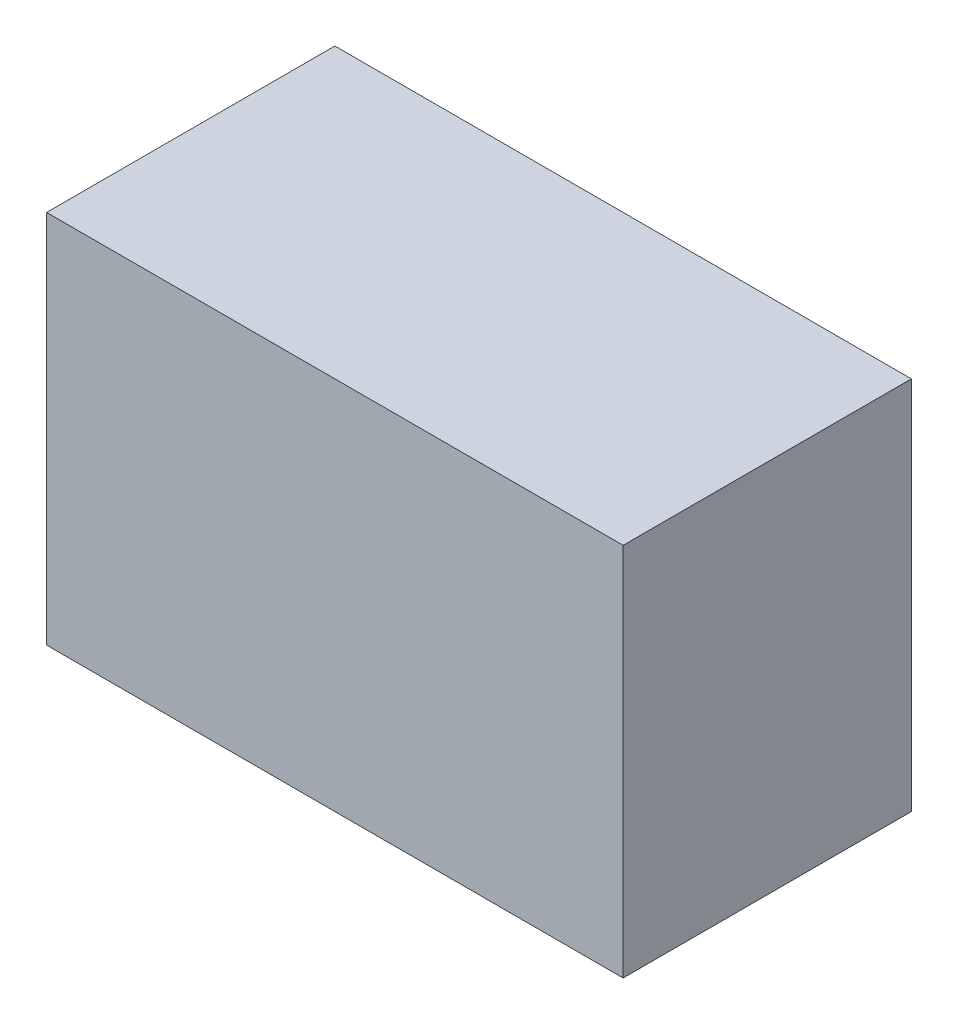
ISO-10303-21;
HEADER;
FILE_DESCRIPTION(('STEP AP214'),'2;1');
FILE_NAME('part.step','',(''),(''),'','','');
FILE_SCHEMA(('AUTOMOTIVE_DESIGN { 1 0 10303 214 1 1 1 1 }'));
ENDSEC;
DATA;
#1=APPLICATION_CONTEXT('core data for automotive mechanical design processes');
#2=APPLICATION_PROTOCOL_DEFINITION('international standard','automotive_design',2000,#1);
#3=PRODUCT_CONTEXT('',#1,'mechanical');
#4=PRODUCT('Part','Part','',(#3));
#5=PRODUCT_RELATED_PRODUCT_CATEGORY('part','',(#4));
#6=PRODUCT_DEFINITION_FORMATION('','',#4);
#7=PRODUCT_DEFINITION_CONTEXT('part definition',#1,'design');
#8=PRODUCT_DEFINITION('design','',#6,#7);
#9=PRODUCT_DEFINITION_SHAPE('','',#8);
#10=(LENGTH_UNIT() NAMED_UNIT(*) SI_UNIT(.MILLI.,.METRE.));
#11=(NAMED_UNIT(*) PLANE_ANGLE_UNIT() SI_UNIT($,.RADIAN.));
#12=(NAMED_UNIT(*) SI_UNIT($,.STERADIAN.) SOLID_ANGLE_UNIT());
#13=UNCERTAINTY_MEASURE_WITH_UNIT(LENGTH_MEASURE(1.E-05),#10,'distance_accuracy_value','');
#14=(GEOMETRIC_REPRESENTATION_CONTEXT(3) GLOBAL_UNCERTAINTY_ASSIGNED_CONTEXT((#13)) GLOBAL_UNIT_ASSIGNED_CONTEXT((#10,
#11,#12)) REPRESENTATION_CONTEXT('',''));
#15=CARTESIAN_POINT('',(0.,0.,0.));
#16=DIRECTION('',(0.,0.,1.));
#17=DIRECTION('',(1.,0.,0.));
#18=AXIS2_PLACEMENT_3D('',#15,#16,#17);
#19=CARTESIAN_POINT('',(-2.54,0.889,2.54));
#20=DIRECTION('',(1.,0.,0.));
#21=DIRECTION('',(0.,0.,-1.));
#22=AXIS2_PLACEMENT_3D('',#19,#20,#21);
#23=PLANE('',#22);
#24=DIRECTION('',(0.,-1.,0.));
#25=VECTOR('',#24,1.);
#26=CARTESIAN_POINT('',(-2.54,0.889,0.));
#27=LINE('',#26,#25);
#28=CARTESIAN_POINT('',(-2.54,0.889,0.));
#29=VERTEX_POINT('',#28);
#30=CARTESIAN_POINT('',(-2.54,-2.413,0.));
#31=VERTEX_POINT('',#30);
#32=EDGE_CURVE('E96',#29,#31,#27,.T.);
#33=ORIENTED_EDGE('',*,*,#32,.T.);
#34=DIRECTION('',(0.,0.,-1.));
#35=VECTOR('',#34,1.);
#36=CARTESIAN_POINT('',(-2.54,-2.413,2.54));
#37=LINE('',#36,#35);
#38=CARTESIAN_POINT('',(-2.54,-2.413,2.54));
#39=VERTEX_POINT('',#38);
#40=EDGE_CURVE('E11',#39,#31,#37,.T.);
#41=ORIENTED_EDGE('',*,*,#40,.F.);
#42=DIRECTION('',(0.,-1.,0.));
#43=VECTOR('',#42,1.);
#44=CARTESIAN_POINT('',(-2.54,0.889,2.54));
#45=LINE('',#44,#43);
#46=CARTESIAN_POINT('',(-2.54,0.889,2.54));
#47=VERTEX_POINT('',#46);
#48=EDGE_CURVE('E84',#47,#39,#45,.T.);
#49=ORIENTED_EDGE('',*,*,#48,.F.);
#50=DIRECTION('',(0.,0.,-1.));
#51=VECTOR('',#50,1.);
#52=CARTESIAN_POINT('',(-2.54,0.889,2.54));
#53=LINE('',#52,#51);
#54=EDGE_CURVE('E92',#47,#29,#53,.T.);
#55=ORIENTED_EDGE('',*,*,#54,.T.);
#56=EDGE_LOOP('',(#33,#41,#49,#55));
#57=FACE_BOUND('',#56,.T.);
#58=ADVANCED_FACE('F33',(#57),#23,.F.);
#59=CARTESIAN_POINT('',(-2.54,-2.413,2.54));
#60=DIRECTION('',(0.,1.,0.));
#61=DIRECTION('',(0.,0.,1.));
#62=AXIS2_PLACEMENT_3D('',#59,#60,#61);
#63=PLANE('',#62);
#64=DIRECTION('',(1.,0.,0.));
#65=VECTOR('',#64,1.);
#66=CARTESIAN_POINT('',(-2.54,-2.413,0.));
#67=LINE('',#66,#65);
#68=CARTESIAN_POINT('',(2.54,-2.413,0.));
#69=VERTEX_POINT('',#68);
#70=EDGE_CURVE('E88',#31,#69,#67,.T.);
#71=ORIENTED_EDGE('',*,*,#70,.T.);
#72=DIRECTION('',(0.,0.,-1.));
#73=VECTOR('',#72,1.);
#74=CARTESIAN_POINT('',(2.54,-2.413,2.54));
#75=LINE('',#74,#73);
#76=CARTESIAN_POINT('',(2.54,-2.413,2.54));
#77=VERTEX_POINT('',#76);
#78=EDGE_CURVE('E41',#77,#69,#75,.T.);
#79=ORIENTED_EDGE('',*,*,#78,.F.);
#80=DIRECTION('',(1.,0.,0.));
#81=VECTOR('',#80,1.);
#82=CARTESIAN_POINT('',(-2.54,-2.413,2.54));
#83=LINE('',#82,#81);
#84=EDGE_CURVE('E79',#39,#77,#83,.T.);
#85=ORIENTED_EDGE('',*,*,#84,.F.);
#86=ORIENTED_EDGE('',*,*,#40,.T.);
#87=EDGE_LOOP('',(#71,#79,#85,#86));
#88=FACE_BOUND('',#87,.T.);
#89=ADVANCED_FACE('F87',(#88),#63,.F.);
#90=CARTESIAN_POINT('',(2.54,-2.413,2.54));
#91=DIRECTION('',(-1.,0.,0.));
#92=DIRECTION('',(0.,0.,1.));
#93=AXIS2_PLACEMENT_3D('',#90,#91,#92);
#94=PLANE('',#93);
#95=DIRECTION('',(0.,1.,0.));
#96=VECTOR('',#95,1.);
#97=CARTESIAN_POINT('',(2.54,-2.413,0.));
#98=LINE('',#97,#96);
#99=CARTESIAN_POINT('',(2.54,0.889,0.));
#100=VERTEX_POINT('',#99);
#101=EDGE_CURVE('E66',#69,#100,#98,.T.);
#102=ORIENTED_EDGE('',*,*,#101,.T.);
#103=DIRECTION('',(0.,0.,-1.));
#104=VECTOR('',#103,1.);
#105=CARTESIAN_POINT('',(2.54,0.889,2.54));
#106=LINE('',#105,#104);
#107=CARTESIAN_POINT('',(2.54,0.889,2.54));
#108=VERTEX_POINT('',#107);
#109=EDGE_CURVE('E89',#108,#100,#106,.T.);
#110=ORIENTED_EDGE('',*,*,#109,.F.);
#111=DIRECTION('',(0.,1.,0.));
#112=VECTOR('',#111,1.);
#113=CARTESIAN_POINT('',(2.54,-2.413,2.54));
#114=LINE('',#113,#112);
#115=EDGE_CURVE('E82',#77,#108,#114,.T.);
#116=ORIENTED_EDGE('',*,*,#115,.F.);
#117=ORIENTED_EDGE('',*,*,#78,.T.);
#118=EDGE_LOOP('',(#102,#110,#116,#117));
#119=FACE_BOUND('',#118,.T.);
#120=ADVANCED_FACE('F90',(#119),#94,.F.);
#121=CARTESIAN_POINT('',(2.54,0.889,2.54));
#122=DIRECTION('',(0.,-1.,0.));
#123=DIRECTION('',(0.,0.,-1.));
#124=AXIS2_PLACEMENT_3D('',#121,#122,#123);
#125=PLANE('',#124);
#126=DIRECTION('',(-1.,0.,0.));
#127=VECTOR('',#126,1.);
#128=CARTESIAN_POINT('',(2.54,0.889,0.));
#129=LINE('',#128,#127);
#130=EDGE_CURVE('E72',#100,#29,#129,.T.);
#131=ORIENTED_EDGE('',*,*,#130,.T.);
#132=ORIENTED_EDGE('',*,*,#54,.F.);
#133=DIRECTION('',(-1.,0.,0.));
#134=VECTOR('',#133,1.);
#135=CARTESIAN_POINT('',(2.54,0.889,2.54));
#136=LINE('',#135,#134);
#137=EDGE_CURVE('E49',#108,#47,#136,.T.);
#138=ORIENTED_EDGE('',*,*,#137,.F.);
#139=ORIENTED_EDGE('',*,*,#109,.T.);
#140=EDGE_LOOP('',(#131,#132,#138,#139));
#141=FACE_BOUND('',#140,.T.);
#142=ADVANCED_FACE('F103',(#141),#125,.F.);
#143=CARTESIAN_POINT('',(0.,0.,2.54));
#144=DIRECTION('',(0.,0.,1.));
#145=DIRECTION('',(1.,0.,0.));
#146=AXIS2_PLACEMENT_3D('',#143,#144,#145);
#147=PLANE('',#146);
#148=ORIENTED_EDGE('',*,*,#48,.T.);
#149=ORIENTED_EDGE('',*,*,#84,.T.);
#150=ORIENTED_EDGE('',*,*,#115,.T.);
#151=ORIENTED_EDGE('',*,*,#137,.T.);
#152=EDGE_LOOP('',(#148,#149,#150,#151));
#153=FACE_BOUND('',#152,.T.);
#154=ADVANCED_FACE('F80',(#153),#147,.T.);
#155=CARTESIAN_POINT('',(0.,0.,0.));
#156=DIRECTION('',(0.,0.,1.));
#157=DIRECTION('',(1.,0.,0.));
#158=AXIS2_PLACEMENT_3D('',#155,#156,#157);
#159=PLANE('',#158);
#160=ORIENTED_EDGE('',*,*,#32,.F.);
#161=ORIENTED_EDGE('',*,*,#130,.F.);
#162=ORIENTED_EDGE('',*,*,#101,.F.);
#163=ORIENTED_EDGE('',*,*,#70,.F.);
#164=EDGE_LOOP('',(#160,#161,#162,#163));
#165=FACE_BOUND('',#164,.T.);
#166=ADVANCED_FACE('F106',(#165),#159,.F.);
#167=CLOSED_SHELL('',(#58,#89,#120,#142,#154,#166));
#168=MANIFOLD_SOLID_BREP('B2',#167);
#169=ADVANCED_BREP_SHAPE_REPRESENTATION('',(#18,#168),#14);
#170=SHAPE_DEFINITION_REPRESENTATION(#9,#169);
ENDSEC;
END-ISO-10303-21;
